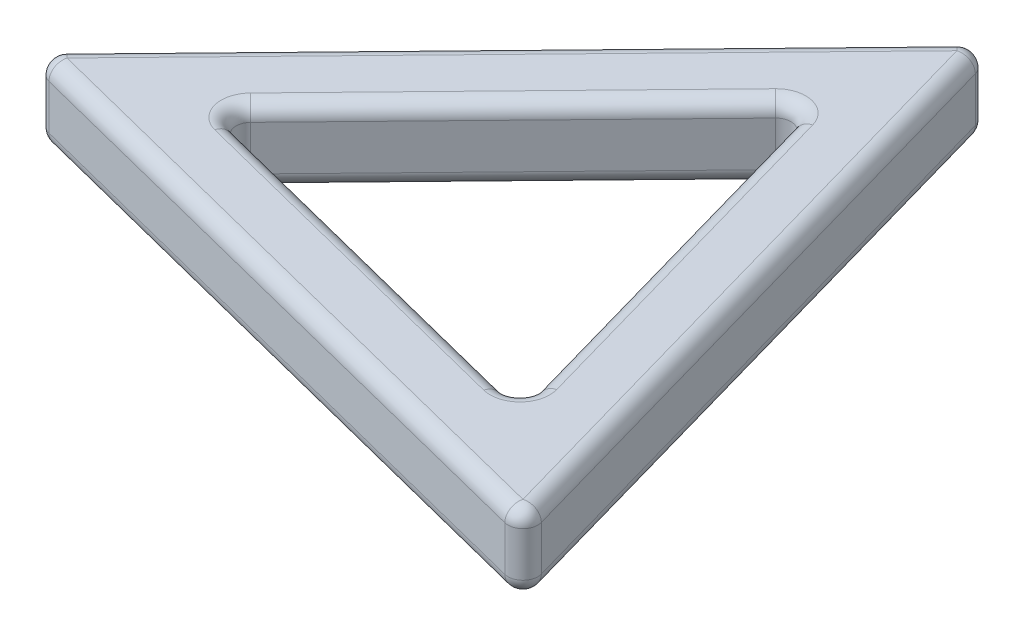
from build123d import *

# Parameters (mm, degrees)
EXTRUDE1_DEPTH = 10
FILLET1_R      = 2


with BuildPart() as part:
    # Sketch1 → Extrude1 (new body)
    with BuildSketch(Plane(origin=(0, 0, 0), x_dir=(1, 0, 0), z_dir=(0, 1, 0))):
        Polygon((37.839987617, -36.780043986), (12.932458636, 51.160412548), (-50.772446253, -14.380368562), align=None)
        Polygon((23.498416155, -22.840197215), (8.030982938, 31.770323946), (-31.529399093, -8.930126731), align=None, mode=Mode.SUBTRACT)
    extrude(amount=EXTRUDE1_DEPTH)

    # Fillet1
    fillet1_edges = [part.edges().sort_by_distance(p)[0] for p in [
        (-18.919993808, 10, -18.390021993),
        (-4.015491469, 0, 15.885161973),
        (-31.529399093, 5, 8.930126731),
        (15.764699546, 0, -4.465063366),
        (23.498416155, 5, 22.840197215),
        (-11.749208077, 0, -11.420098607),
        (8.030982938, 5, -31.770323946),
        (-4.015491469, 10, 15.885161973),
        (15.764699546, 10, -4.465063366),
        (-11.749208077, 10, -11.420098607),
        (-18.919993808, 0, -18.390021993),
        (-6.466229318, 10, 25.580206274),
        (25.386223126, 0, -7.190184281),
        (-6.466229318, 0, 25.580206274),
        (-50.772446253, 5, 14.380368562),
        (12.932458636, 5, -51.160412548),
        (37.839987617, 5, 36.780043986),
        (25.386223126, 10, -7.190184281),
    ]]
    fillet(fillet1_edges, radius=FILLET1_R)


solid = part.part
